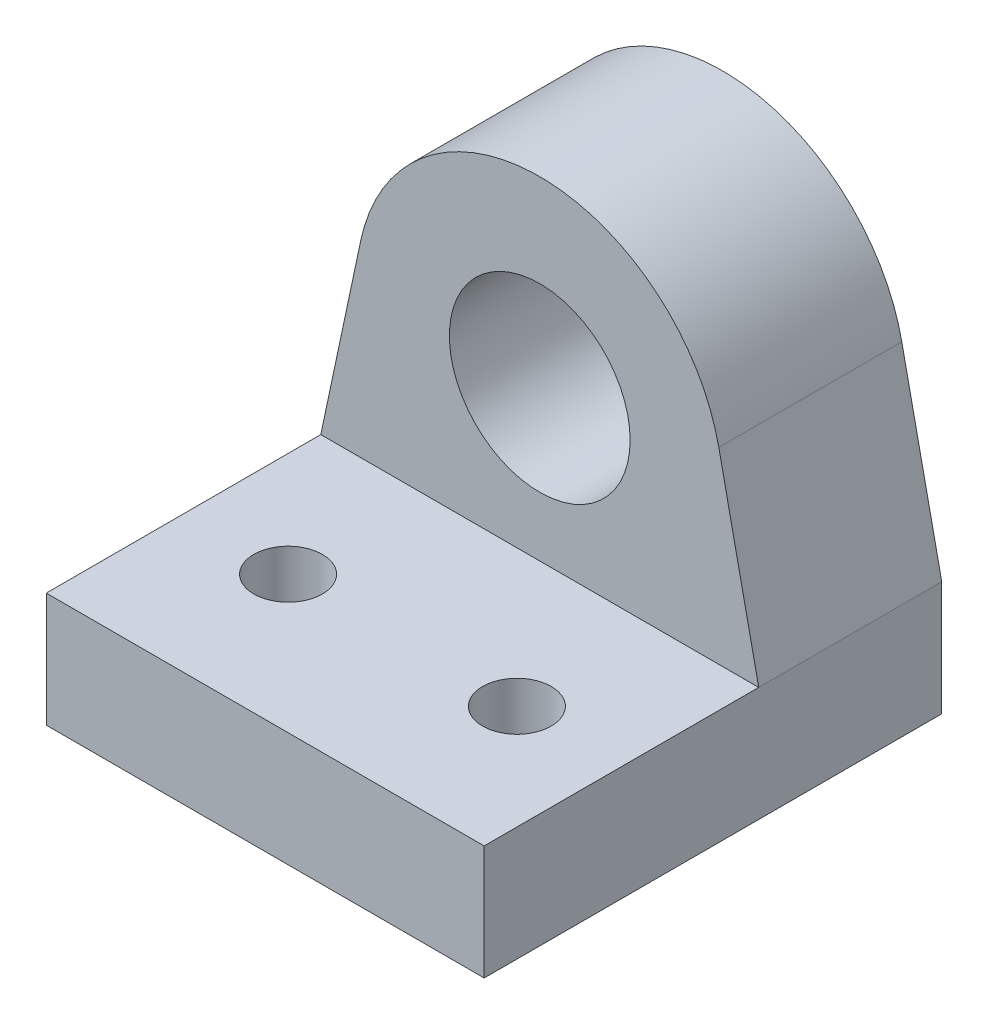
from build123d import *

# Parameters (mm, degrees)
SKETCH_1_R          = 3.95
EXTRUDE_1_DEPTH     = 8
SKETCH_3_W          = 19.14085772
SKETCH_3_H          = 20
EXTRUDE_2_DEPTH     = 5
SKETCH_4_R          = 1.5
CUT_EXTRUDE_1_DEPTH = 8
EXTRUDE_START       = 3
EXTRUDE_3_DEPTH     = 3


with BuildPart() as part:
    # Sketch 1 → Extrude 1 (new body)
    with BuildSketch(Plane.XY):
        with BuildLine():
            Line((9.57042886, -6.55), (-9.57042886, -6.55))
            Line((-9.57042886, -6.55), (-7.825285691, 1.662800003))
            ThreePointArc((-7.825285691, 1.662800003), (0, 8), (7.825285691, 1.662800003))
            Line((7.825285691, 1.662800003), (9.57042886, -6.55))
        make_face()
        Circle(SKETCH_1_R, mode=Mode.SUBTRACT)
    extrude(amount=EXTRUDE_1_DEPTH)

    # Sketch 3 → Extrude 2 (add)
    with BuildSketch(Plane.XZ.offset(6.55)):
        with Locations((0, 10)):
            Rectangle(SKETCH_3_W, SKETCH_3_H)
    extrude(amount=EXTRUDE_2_DEPTH)

    # Sketch 4 → Cut-Extrude 1 (cut)
    with BuildSketch(Plane(origin=(0, -6.55, 0), x_dir=(1, 0, 0), z_dir=(0, 1, 0))):
        with Locations(Location((-5, -14, 0), (0, 0, 180))):
            Circle(SKETCH_4_R)
        with Locations(Location((5, -14, 0), (0, 0, 180))):
            Circle(SKETCH_4_R)
    extrude(amount=-CUT_EXTRUDE_1_DEPTH, mode=Mode.SUBTRACT)

    # Sketch 6 → Extrude 3 (add)
    with BuildSketch(Plane(origin=(0, 0, 0), x_dir=(-1, 0, 0), z_dir=(0, 0, -1)).offset(EXTRUDE_START)):
        with BuildLine():
            Line((7.336205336, -3.19062553), (8.357573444, -0.842193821))
            Line((8.357573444, -0.842193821), (9.57042886, -6.55))
            Line((9.57042886, -6.55), (9.57042886, -11.55))
            Line((9.57042886, -11.55), (0, -11.55))
            Line((0, -11.55), (0, -8))
            ThreePointArc((0, -8), (4.386057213, -6.690478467), (7.336205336, -3.19062553))
        make_face()
    extrude(amount=-EXTRUDE_3_DEPTH)


solid = part.part
